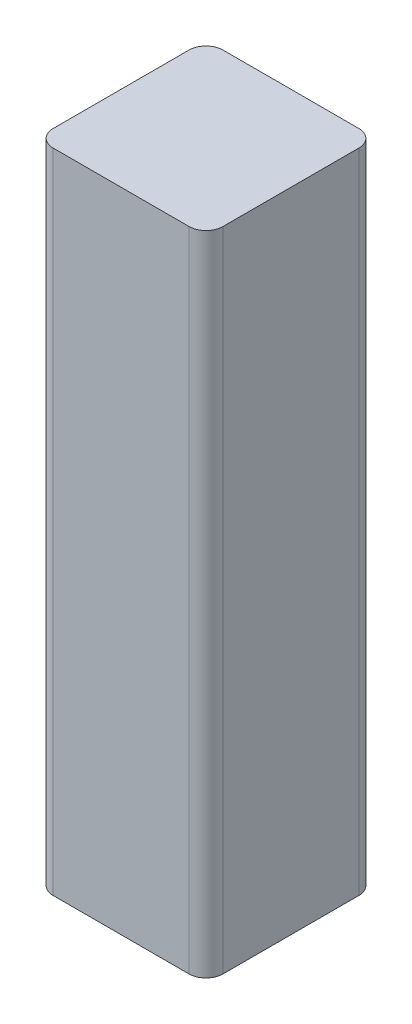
ISO-10303-21;
HEADER;
FILE_DESCRIPTION(('STEP AP214'),'2;1');
FILE_NAME('part.step','',(''),(''),'','','');
FILE_SCHEMA(('AUTOMOTIVE_DESIGN { 1 0 10303 214 1 1 1 1 }'));
ENDSEC;
DATA;
#1=APPLICATION_CONTEXT('core data for automotive mechanical design processes');
#2=APPLICATION_PROTOCOL_DEFINITION('international standard','automotive_design',2000,#1);
#3=PRODUCT_CONTEXT('',#1,'mechanical');
#4=PRODUCT('Part','Part','',(#3));
#5=PRODUCT_RELATED_PRODUCT_CATEGORY('part','',(#4));
#6=PRODUCT_DEFINITION_FORMATION('','',#4);
#7=PRODUCT_DEFINITION_CONTEXT('part definition',#1,'design');
#8=PRODUCT_DEFINITION('design','',#6,#7);
#9=PRODUCT_DEFINITION_SHAPE('','',#8);
#10=(LENGTH_UNIT() NAMED_UNIT(*) SI_UNIT(.MILLI.,.METRE.));
#11=(NAMED_UNIT(*) PLANE_ANGLE_UNIT() SI_UNIT($,.RADIAN.));
#12=(NAMED_UNIT(*) SI_UNIT($,.STERADIAN.) SOLID_ANGLE_UNIT());
#13=UNCERTAINTY_MEASURE_WITH_UNIT(LENGTH_MEASURE(1.E-05),#10,'distance_accuracy_value','');
#14=(GEOMETRIC_REPRESENTATION_CONTEXT(3) GLOBAL_UNCERTAINTY_ASSIGNED_CONTEXT((#13)) GLOBAL_UNIT_ASSIGNED_CONTEXT((#10,
#11,#12)) REPRESENTATION_CONTEXT('',''));
#15=CARTESIAN_POINT('',(0.,0.,0.));
#16=DIRECTION('',(0.,0.,1.));
#17=DIRECTION('',(1.,0.,0.));
#18=AXIS2_PLACEMENT_3D('',#15,#16,#17);
#19=CARTESIAN_POINT('',(40.,305.,40.));
#20=DIRECTION('',(-1.,0.,0.));
#21=DIRECTION('',(0.,0.,1.));
#22=AXIS2_PLACEMENT_3D('',#19,#20,#21);
#23=PLANE('',#22);
#24=DIRECTION('',(0.,0.,-1.));
#25=VECTOR('',#24,1.);
#26=CARTESIAN_POINT('',(40.,0.,40.));
#27=LINE('',#26,#25);
#28=CARTESIAN_POINT('',(40.,0.,32.));
#29=VERTEX_POINT('',#28);
#30=CARTESIAN_POINT('',(40.,0.,-32.));
#31=VERTEX_POINT('',#30);
#32=EDGE_CURVE('E132',#29,#31,#27,.T.);
#33=ORIENTED_EDGE('',*,*,#32,.T.);
#34=DIRECTION('',(0.,-1.,0.));
#35=VECTOR('',#34,1.);
#36=CARTESIAN_POINT('',(40.,305.,-32.));
#37=LINE('',#36,#35);
#38=CARTESIAN_POINT('',(40.,305.,-32.));
#39=VERTEX_POINT('',#38);
#40=EDGE_CURVE('E154',#31,#39,#37,.F.);
#41=ORIENTED_EDGE('',*,*,#40,.T.);
#42=DIRECTION('',(0.,0.,-1.));
#43=VECTOR('',#42,1.);
#44=CARTESIAN_POINT('',(40.,305.,40.));
#45=LINE('',#44,#43);
#46=CARTESIAN_POINT('',(40.,305.,32.));
#47=VERTEX_POINT('',#46);
#48=EDGE_CURVE('E130',#47,#39,#45,.T.);
#49=ORIENTED_EDGE('',*,*,#48,.F.);
#50=DIRECTION('',(0.,-1.,0.));
#51=VECTOR('',#50,1.);
#52=CARTESIAN_POINT('',(40.,305.,32.));
#53=LINE('',#52,#51);
#54=EDGE_CURVE('E151',#47,#29,#53,.T.);
#55=ORIENTED_EDGE('',*,*,#54,.T.);
#56=EDGE_LOOP('',(#33,#41,#49,#55));
#57=FACE_BOUND('',#56,.T.);
#58=ADVANCED_FACE('F35',(#57),#23,.F.);
#59=CARTESIAN_POINT('',(-40.,305.,-40.));
#60=DIRECTION('',(0.,0.,1.));
#61=DIRECTION('',(1.,0.,0.));
#62=AXIS2_PLACEMENT_3D('',#59,#60,#61);
#63=PLANE('',#62);
#64=DIRECTION('',(-1.,0.,0.));
#65=VECTOR('',#64,1.);
#66=CARTESIAN_POINT('',(-40.,0.,-40.));
#67=LINE('',#66,#65);
#68=CARTESIAN_POINT('',(32.,0.,-40.));
#69=VERTEX_POINT('',#68);
#70=CARTESIAN_POINT('',(-32.,0.,-40.));
#71=VERTEX_POINT('',#70);
#72=EDGE_CURVE('E128',#69,#71,#67,.T.);
#73=ORIENTED_EDGE('',*,*,#72,.T.);
#74=DIRECTION('',(0.,-1.,0.));
#75=VECTOR('',#74,1.);
#76=CARTESIAN_POINT('',(-32.,305.,-40.));
#77=LINE('',#76,#75);
#78=CARTESIAN_POINT('',(-32.,305.,-40.));
#79=VERTEX_POINT('',#78);
#80=EDGE_CURVE('E106',#71,#79,#77,.F.);
#81=ORIENTED_EDGE('',*,*,#80,.T.);
#82=DIRECTION('',(-1.,0.,0.));
#83=VECTOR('',#82,1.);
#84=CARTESIAN_POINT('',(-40.,305.,-40.));
#85=LINE('',#84,#83);
#86=CARTESIAN_POINT('',(32.,305.,-40.));
#87=VERTEX_POINT('',#86);
#88=EDGE_CURVE('E168',#87,#79,#85,.T.);
#89=ORIENTED_EDGE('',*,*,#88,.F.);
#90=DIRECTION('',(0.,-1.,0.));
#91=VECTOR('',#90,1.);
#92=CARTESIAN_POINT('',(32.,305.,-40.));
#93=LINE('',#92,#91);
#94=EDGE_CURVE('E111',#87,#69,#93,.T.);
#95=ORIENTED_EDGE('',*,*,#94,.T.);
#96=EDGE_LOOP('',(#73,#81,#89,#95));
#97=FACE_BOUND('',#96,.T.);
#98=ADVANCED_FACE('F173',(#97),#63,.F.);
#99=CARTESIAN_POINT('',(-40.,305.,40.));
#100=DIRECTION('',(1.,0.,0.));
#101=DIRECTION('',(0.,0.,-1.));
#102=AXIS2_PLACEMENT_3D('',#99,#100,#101);
#103=PLANE('',#102);
#104=DIRECTION('',(0.,0.,1.));
#105=VECTOR('',#104,1.);
#106=CARTESIAN_POINT('',(-40.,305.,40.));
#107=LINE('',#106,#105);
#108=CARTESIAN_POINT('',(-40.,305.,-32.));
#109=VERTEX_POINT('',#108);
#110=CARTESIAN_POINT('',(-40.,305.,32.));
#111=VERTEX_POINT('',#110);
#112=EDGE_CURVE('E120',#109,#111,#107,.T.);
#113=ORIENTED_EDGE('',*,*,#112,.F.);
#114=DIRECTION('',(0.,-1.,0.));
#115=VECTOR('',#114,1.);
#116=CARTESIAN_POINT('',(-40.,305.,-32.));
#117=LINE('',#116,#115);
#118=CARTESIAN_POINT('',(-40.,0.,-32.));
#119=VERTEX_POINT('',#118);
#120=EDGE_CURVE('E105',#109,#119,#117,.T.);
#121=ORIENTED_EDGE('',*,*,#120,.T.);
#122=DIRECTION('',(0.,0.,1.));
#123=VECTOR('',#122,1.);
#124=CARTESIAN_POINT('',(-40.,0.,40.));
#125=LINE('',#124,#123);
#126=CARTESIAN_POINT('',(-40.,0.,32.));
#127=VERTEX_POINT('',#126);
#128=EDGE_CURVE('E118',#119,#127,#125,.T.);
#129=ORIENTED_EDGE('',*,*,#128,.T.);
#130=DIRECTION('',(0.,-1.,0.));
#131=VECTOR('',#130,1.);
#132=CARTESIAN_POINT('',(-40.,305.,32.));
#133=LINE('',#132,#131);
#134=EDGE_CURVE('E122',#127,#111,#133,.F.);
#135=ORIENTED_EDGE('',*,*,#134,.T.);
#136=EDGE_LOOP('',(#113,#121,#129,#135));
#137=FACE_BOUND('',#136,.T.);
#138=ADVANCED_FACE('F117',(#137),#103,.F.);
#139=CARTESIAN_POINT('',(-40.,305.,40.));
#140=DIRECTION('',(0.,0.,-1.));
#141=DIRECTION('',(-1.,0.,0.));
#142=AXIS2_PLACEMENT_3D('',#139,#140,#141);
#143=PLANE('',#142);
#144=DIRECTION('',(1.,0.,0.));
#145=VECTOR('',#144,1.);
#146=CARTESIAN_POINT('',(-40.,305.,40.));
#147=LINE('',#146,#145);
#148=CARTESIAN_POINT('',(-32.,305.,40.));
#149=VERTEX_POINT('',#148);
#150=CARTESIAN_POINT('',(32.,305.,40.));
#151=VERTEX_POINT('',#150);
#152=EDGE_CURVE('E136',#149,#151,#147,.T.);
#153=ORIENTED_EDGE('',*,*,#152,.F.);
#154=DIRECTION('',(0.,-1.,0.));
#155=VECTOR('',#154,1.);
#156=CARTESIAN_POINT('',(-32.,305.,40.));
#157=LINE('',#156,#155);
#158=CARTESIAN_POINT('',(-32.,0.,40.));
#159=VERTEX_POINT('',#158);
#160=EDGE_CURVE('E11',#149,#159,#157,.T.);
#161=ORIENTED_EDGE('',*,*,#160,.T.);
#162=DIRECTION('',(1.,0.,0.));
#163=VECTOR('',#162,1.);
#164=CARTESIAN_POINT('',(-40.,0.,40.));
#165=LINE('',#164,#163);
#166=CARTESIAN_POINT('',(32.,0.,40.));
#167=VERTEX_POINT('',#166);
#168=EDGE_CURVE('E127',#159,#167,#165,.T.);
#169=ORIENTED_EDGE('',*,*,#168,.T.);
#170=DIRECTION('',(0.,-1.,0.));
#171=VECTOR('',#170,1.);
#172=CARTESIAN_POINT('',(32.,305.,40.));
#173=LINE('',#172,#171);
#174=EDGE_CURVE('E43',#167,#151,#173,.F.);
#175=ORIENTED_EDGE('',*,*,#174,.T.);
#176=EDGE_LOOP('',(#153,#161,#169,#175));
#177=FACE_BOUND('',#176,.T.);
#178=ADVANCED_FACE('F180',(#177),#143,.F.);
#179=CARTESIAN_POINT('',(0.,305.,0.));
#180=DIRECTION('',(0.,-1.,0.));
#181=DIRECTION('',(0.,0.,-1.));
#182=AXIS2_PLACEMENT_3D('',#179,#180,#181);
#183=PLANE('',#182);
#184=ORIENTED_EDGE('',*,*,#88,.T.);
#185=CARTESIAN_POINT('',(-32.,305.,-32.));
#186=DIRECTION('',(0.,-1.,0.));
#187=DIRECTION('',(0.,0.,-1.));
#188=AXIS2_PLACEMENT_3D('',#185,#186,#187);
#189=CIRCLE('',#188,8.);
#190=EDGE_CURVE('E149',#79,#109,#189,.F.);
#191=ORIENTED_EDGE('',*,*,#190,.T.);
#192=ORIENTED_EDGE('',*,*,#112,.T.);
#193=CARTESIAN_POINT('',(-32.,305.,32.));
#194=DIRECTION('',(0.,-1.,0.));
#195=DIRECTION('',(0.,0.,-1.));
#196=AXIS2_PLACEMENT_3D('',#193,#194,#195);
#197=CIRCLE('',#196,8.);
#198=EDGE_CURVE('E56',#111,#149,#197,.F.);
#199=ORIENTED_EDGE('',*,*,#198,.T.);
#200=ORIENTED_EDGE('',*,*,#152,.T.);
#201=CARTESIAN_POINT('',(32.,305.,32.));
#202=DIRECTION('',(0.,-1.,0.));
#203=DIRECTION('',(0.,0.,-1.));
#204=AXIS2_PLACEMENT_3D('',#201,#202,#203);
#205=CIRCLE('',#204,8.);
#206=EDGE_CURVE('E144',#151,#47,#205,.F.);
#207=ORIENTED_EDGE('',*,*,#206,.T.);
#208=ORIENTED_EDGE('',*,*,#48,.T.);
#209=CARTESIAN_POINT('',(32.,305.,-32.));
#210=DIRECTION('',(0.,-1.,0.));
#211=DIRECTION('',(0.,0.,-1.));
#212=AXIS2_PLACEMENT_3D('',#209,#210,#211);
#213=CIRCLE('',#212,8.);
#214=EDGE_CURVE('E147',#39,#87,#213,.F.);
#215=ORIENTED_EDGE('',*,*,#214,.T.);
#216=EDGE_LOOP('',(#184,#191,#192,#199,#200,#207,#208,#215));
#217=FACE_BOUND('',#216,.T.);
#218=ADVANCED_FACE('F165',(#217),#183,.F.);
#219=CARTESIAN_POINT('',(0.,0.,0.));
#220=DIRECTION('',(0.,-1.,0.));
#221=DIRECTION('',(0.,0.,-1.));
#222=AXIS2_PLACEMENT_3D('',#219,#220,#221);
#223=PLANE('',#222);
#224=ORIENTED_EDGE('',*,*,#128,.F.);
#225=CARTESIAN_POINT('',(-32.,0.,-32.));
#226=DIRECTION('',(0.,-1.,0.));
#227=DIRECTION('',(0.,0.,-1.));
#228=AXIS2_PLACEMENT_3D('',#225,#226,#227);
#229=CIRCLE('',#228,8.);
#230=EDGE_CURVE('E101',#119,#71,#229,.T.);
#231=ORIENTED_EDGE('',*,*,#230,.T.);
#232=ORIENTED_EDGE('',*,*,#72,.F.);
#233=CARTESIAN_POINT('',(32.,0.,-32.));
#234=DIRECTION('',(0.,-1.,0.));
#235=DIRECTION('',(0.,0.,-1.));
#236=AXIS2_PLACEMENT_3D('',#233,#234,#235);
#237=CIRCLE('',#236,8.);
#238=EDGE_CURVE('E112',#69,#31,#237,.T.);
#239=ORIENTED_EDGE('',*,*,#238,.T.);
#240=ORIENTED_EDGE('',*,*,#32,.F.);
#241=CARTESIAN_POINT('',(32.,0.,32.));
#242=DIRECTION('',(0.,-1.,0.));
#243=DIRECTION('',(0.,0.,-1.));
#244=AXIS2_PLACEMENT_3D('',#241,#242,#243);
#245=CIRCLE('',#244,8.);
#246=EDGE_CURVE('E121',#29,#167,#245,.T.);
#247=ORIENTED_EDGE('',*,*,#246,.T.);
#248=ORIENTED_EDGE('',*,*,#168,.F.);
#249=CARTESIAN_POINT('',(-32.,0.,32.));
#250=DIRECTION('',(0.,-1.,0.));
#251=DIRECTION('',(0.,0.,-1.));
#252=AXIS2_PLACEMENT_3D('',#249,#250,#251);
#253=CIRCLE('',#252,8.);
#254=EDGE_CURVE('E126',#159,#127,#253,.T.);
#255=ORIENTED_EDGE('',*,*,#254,.T.);
#256=EDGE_LOOP('',(#224,#231,#232,#239,#240,#247,#248,#255));
#257=FACE_BOUND('',#256,.T.);
#258=ADVANCED_FACE('F124',(#257),#223,.T.);
#259=CARTESIAN_POINT('',(-32.,305.,-32.));
#260=DIRECTION('',(0.,-1.,0.));
#261=DIRECTION('',(0.,0.,-1.));
#262=AXIS2_PLACEMENT_3D('',#259,#260,#261);
#263=CYLINDRICAL_SURFACE('',#262,8.);
#264=ORIENTED_EDGE('',*,*,#190,.F.);
#265=ORIENTED_EDGE('',*,*,#80,.F.);
#266=ORIENTED_EDGE('',*,*,#230,.F.);
#267=ORIENTED_EDGE('',*,*,#120,.F.);
#268=EDGE_LOOP('',(#264,#265,#266,#267));
#269=FACE_BOUND('',#268,.T.);
#270=ADVANCED_FACE('F104',(#269),#263,.T.);
#271=CARTESIAN_POINT('',(32.,305.,-32.));
#272=DIRECTION('',(0.,-1.,0.));
#273=DIRECTION('',(0.,0.,-1.));
#274=AXIS2_PLACEMENT_3D('',#271,#272,#273);
#275=CYLINDRICAL_SURFACE('',#274,8.);
#276=ORIENTED_EDGE('',*,*,#214,.F.);
#277=ORIENTED_EDGE('',*,*,#40,.F.);
#278=ORIENTED_EDGE('',*,*,#238,.F.);
#279=ORIENTED_EDGE('',*,*,#94,.F.);
#280=EDGE_LOOP('',(#276,#277,#278,#279));
#281=FACE_BOUND('',#280,.T.);
#282=ADVANCED_FACE('F171',(#281),#275,.T.);
#283=CARTESIAN_POINT('',(-32.,305.,32.));
#284=DIRECTION('',(0.,-1.,0.));
#285=DIRECTION('',(0.,0.,-1.));
#286=AXIS2_PLACEMENT_3D('',#283,#284,#285);
#287=CYLINDRICAL_SURFACE('',#286,8.);
#288=ORIENTED_EDGE('',*,*,#198,.F.);
#289=ORIENTED_EDGE('',*,*,#134,.F.);
#290=ORIENTED_EDGE('',*,*,#254,.F.);
#291=ORIENTED_EDGE('',*,*,#160,.F.);
#292=EDGE_LOOP('',(#288,#289,#290,#291));
#293=FACE_BOUND('',#292,.T.);
#294=ADVANCED_FACE('F179',(#293),#287,.T.);
#295=CARTESIAN_POINT('',(32.,305.,32.));
#296=DIRECTION('',(0.,-1.,0.));
#297=DIRECTION('',(0.,0.,-1.));
#298=AXIS2_PLACEMENT_3D('',#295,#296,#297);
#299=CYLINDRICAL_SURFACE('',#298,8.);
#300=ORIENTED_EDGE('',*,*,#206,.F.);
#301=ORIENTED_EDGE('',*,*,#174,.F.);
#302=ORIENTED_EDGE('',*,*,#246,.F.);
#303=ORIENTED_EDGE('',*,*,#54,.F.);
#304=EDGE_LOOP('',(#300,#301,#302,#303));
#305=FACE_BOUND('',#304,.T.);
#306=ADVANCED_FACE('F37',(#305),#299,.T.);
#307=CLOSED_SHELL('',(#58,#98,#138,#178,#218,#258,#270,#282,#294,#306));
#308=MANIFOLD_SOLID_BREP('B2',#307);
#309=ADVANCED_BREP_SHAPE_REPRESENTATION('',(#18,#308),#14);
#310=SHAPE_DEFINITION_REPRESENTATION(#9,#309);
ENDSEC;
END-ISO-10303-21;
